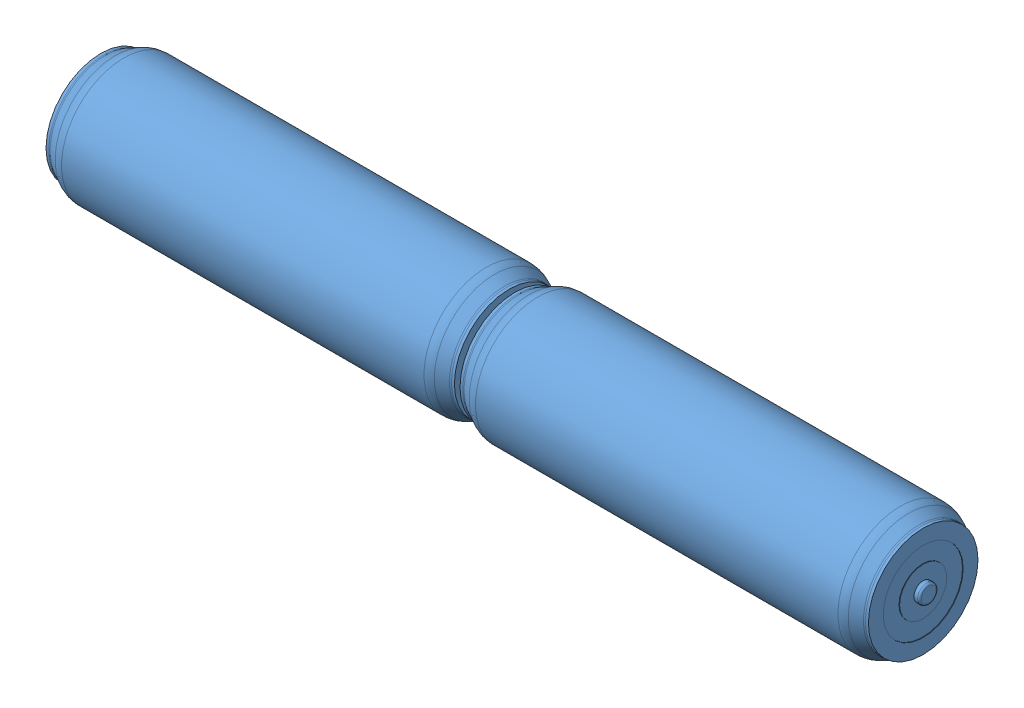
SolidWorks assembly batteries_2_unites.SLDASM, configuration Défaut (file format 4400). Lengths in mm.
Overall size (222.8 33.5 33.5).
2 component instances, 1 part files, 2 mates.
Components (placement in the parent):
- batterie_1_unite-1: batterie_1_unite.SLDPRT [Défaut] at origin size (111.4 33.5 33.5)
- batterie_1_unite-2: batterie_1_unite.SLDPRT [Défaut] at (-111.4 0 0) size (111.4 33.5 33.5)
Mates (geometry in assembly coordinates):
- Coïncidente1: coincident anti-aligned: plane of batterie_1_unite-1 through (0 0 0) normal (-1 0 0); plane of batterie_1_unite-2 through (0 0 0) normal (1 0 0)
- Coaxiale1: concentric aligned: cylinder of batterie_1_unite-1 through (124.5159 0 0) axis (1 0 0) radius 16.75; cylinder of batterie_1_unite-2 through (13.1159 0 0) axis (1 0 0) radius 16.75
